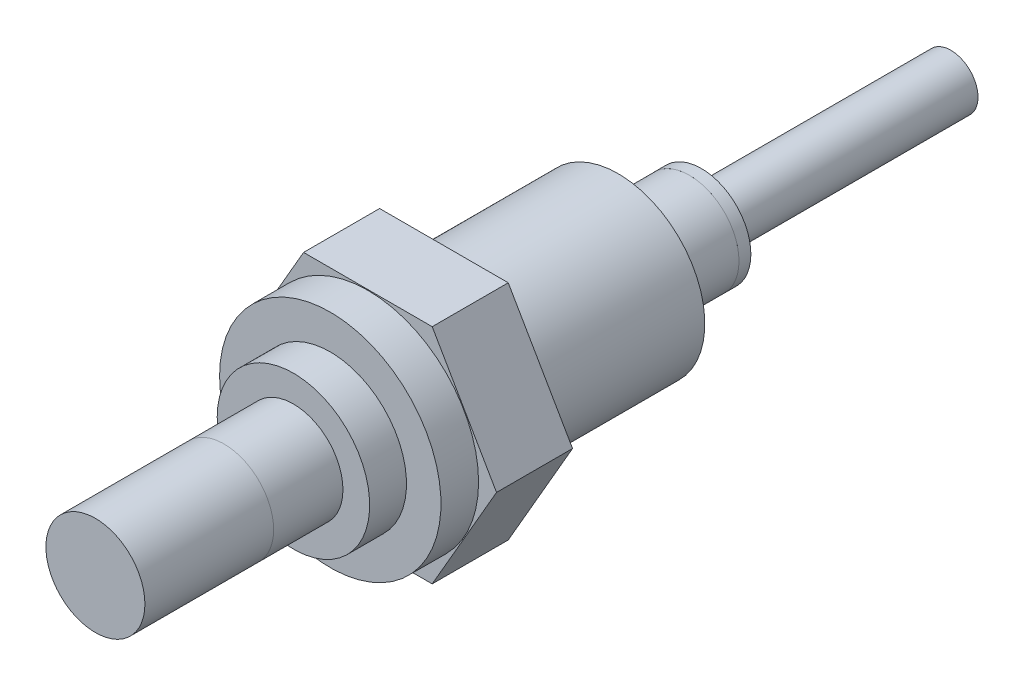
ISO-10303-21;
HEADER;
FILE_DESCRIPTION(('STEP AP214'),'2;1');
FILE_NAME('part.step','',(''),(''),'','','');
FILE_SCHEMA(('AUTOMOTIVE_DESIGN { 1 0 10303 214 1 1 1 1 }'));
ENDSEC;
DATA;
#1=APPLICATION_CONTEXT('core data for automotive mechanical design processes');
#2=APPLICATION_PROTOCOL_DEFINITION('international standard','automotive_design',2000,#1);
#3=PRODUCT_CONTEXT('',#1,'mechanical');
#4=PRODUCT('Part','Part','',(#3));
#5=PRODUCT_RELATED_PRODUCT_CATEGORY('part','',(#4));
#6=PRODUCT_DEFINITION_FORMATION('','',#4);
#7=PRODUCT_DEFINITION_CONTEXT('part definition',#1,'design');
#8=PRODUCT_DEFINITION('design','',#6,#7);
#9=PRODUCT_DEFINITION_SHAPE('','',#8);
#10=(LENGTH_UNIT() NAMED_UNIT(*) SI_UNIT(.MILLI.,.METRE.));
#11=(NAMED_UNIT(*) PLANE_ANGLE_UNIT() SI_UNIT($,.RADIAN.));
#12=(NAMED_UNIT(*) SI_UNIT($,.STERADIAN.) SOLID_ANGLE_UNIT());
#13=UNCERTAINTY_MEASURE_WITH_UNIT(LENGTH_MEASURE(1.E-05),#10,'distance_accuracy_value','');
#14=(GEOMETRIC_REPRESENTATION_CONTEXT(3) GLOBAL_UNCERTAINTY_ASSIGNED_CONTEXT((#13)) GLOBAL_UNIT_ASSIGNED_CONTEXT((#10,
#11,#12)) REPRESENTATION_CONTEXT('',''));
#15=CARTESIAN_POINT('',(0.,0.,0.));
#16=DIRECTION('',(0.,0.,1.));
#17=DIRECTION('',(1.,0.,0.));
#18=AXIS2_PLACEMENT_3D('',#15,#16,#17);
#19=CARTESIAN_POINT('',(0.,1.7526,14.097));
#20=DIRECTION('',(0.,0.,1.));
#21=DIRECTION('',(1.,0.,0.));
#22=AXIS2_PLACEMENT_3D('',#19,#20,#21);
#23=PLANE('',#22);
#24=CARTESIAN_POINT('',(0.,0.,14.097));
#25=DIRECTION('',(0.,0.,1.));
#26=DIRECTION('',(1.,0.,0.));
#27=AXIS2_PLACEMENT_3D('',#24,#25,#26);
#28=CIRCLE('',#27,3.175);
#29=CARTESIAN_POINT('',(3.175,0.,14.097));
#30=VERTEX_POINT('',#29);
#31=EDGE_CURVE('E11',#30,#30,#28,.T.);
#32=ORIENTED_EDGE('',*,*,#31,.F.);
#33=EDGE_LOOP('',(#32));
#34=FACE_BOUND('',#33,.T.);
#35=CARTESIAN_POINT('',(0.,0.,14.097));
#36=DIRECTION('',(0.,0.,1.));
#37=DIRECTION('',(1.,0.,0.));
#38=AXIS2_PLACEMENT_3D('',#35,#36,#37);
#39=CIRCLE('',#38,1.7526);
#40=CARTESIAN_POINT('',(1.7526,0.,14.097));
#41=VERTEX_POINT('',#40);
#42=EDGE_CURVE('E70',#41,#41,#39,.T.);
#43=ORIENTED_EDGE('',*,*,#42,.T.);
#44=EDGE_LOOP('',(#43));
#45=FACE_BOUND('',#44,.T.);
#46=ADVANCED_FACE('F42',(#34,#45),#23,.F.);
#47=CARTESIAN_POINT('',(0.,0.,22.352));
#48=DIRECTION('',(0.,0.,1.));
#49=DIRECTION('',(1.,0.,0.));
#50=AXIS2_PLACEMENT_3D('',#47,#48,#49);
#51=CYLINDRICAL_SURFACE('',#50,3.175);
#52=CARTESIAN_POINT('',(0.,0.,22.352));
#53=DIRECTION('',(0.,0.,1.));
#54=DIRECTION('',(1.,0.,0.));
#55=AXIS2_PLACEMENT_3D('',#52,#53,#54);
#56=CIRCLE('',#55,3.175);
#57=CARTESIAN_POINT('',(3.175,0.,22.352));
#58=VERTEX_POINT('',#57);
#59=EDGE_CURVE('E48',#58,#58,#56,.T.);
#60=ORIENTED_EDGE('',*,*,#59,.F.);
#61=EDGE_LOOP('',(#60));
#62=FACE_BOUND('',#61,.T.);
#63=ORIENTED_EDGE('',*,*,#31,.T.);
#64=EDGE_LOOP('',(#63));
#65=FACE_BOUND('',#64,.T.);
#66=ADVANCED_FACE('F112',(#62,#65),#51,.T.);
#67=CARTESIAN_POINT('',(0.,3.175,22.352));
#68=DIRECTION('',(0.,0.,-1.));
#69=DIRECTION('',(-1.,0.,0.));
#70=AXIS2_PLACEMENT_3D('',#67,#68,#69);
#71=PLANE('',#70);
#72=ORIENTED_EDGE('',*,*,#59,.T.);
#73=EDGE_LOOP('',(#72));
#74=FACE_BOUND('',#73,.T.);
#75=ADVANCED_FACE('F107',(#74),#71,.F.);
#76=CARTESIAN_POINT('',(0.,0.,-32.512));
#77=DIRECTION('',(0.,0.,1.));
#78=DIRECTION('',(1.,0.,0.));
#79=AXIS2_PLACEMENT_3D('',#76,#77,#78);
#80=PLANE('',#79);
#81=CARTESIAN_POINT('',(0.,0.,-32.512));
#82=DIRECTION('',(0.,0.,1.));
#83=DIRECTION('',(1.,0.,0.));
#84=AXIS2_PLACEMENT_3D('',#81,#82,#83);
#85=CIRCLE('',#84,1.7399);
#86=CARTESIAN_POINT('',(1.7399,0.,-32.512));
#87=VERTEX_POINT('',#86);
#88=EDGE_CURVE('E52',#87,#87,#85,.T.);
#89=ORIENTED_EDGE('',*,*,#88,.F.);
#90=EDGE_LOOP('',(#89));
#91=FACE_BOUND('',#90,.T.);
#92=ADVANCED_FACE('F102',(#91),#80,.F.);
#93=CARTESIAN_POINT('',(0.,0.,22.352));
#94=DIRECTION('',(0.,0.,1.));
#95=DIRECTION('',(1.,0.,0.));
#96=AXIS2_PLACEMENT_3D('',#93,#94,#95);
#97=CYLINDRICAL_SURFACE('',#96,1.7399);
#98=CARTESIAN_POINT('',(0.,0.,-16.51));
#99=DIRECTION('',(0.,0.,1.));
#100=DIRECTION('',(1.,0.,0.));
#101=AXIS2_PLACEMENT_3D('',#98,#99,#100);
#102=CIRCLE('',#101,1.7399);
#103=CARTESIAN_POINT('',(1.7399,0.,-16.51));
#104=VERTEX_POINT('',#103);
#105=EDGE_CURVE('E56',#104,#104,#102,.T.);
#106=ORIENTED_EDGE('',*,*,#105,.F.);
#107=EDGE_LOOP('',(#106));
#108=FACE_BOUND('',#107,.T.);
#109=ORIENTED_EDGE('',*,*,#88,.T.);
#110=EDGE_LOOP('',(#109));
#111=FACE_BOUND('',#110,.T.);
#112=ADVANCED_FACE('F96',(#108,#111),#97,.T.);
#113=CARTESIAN_POINT('',(0.,1.7399,-16.51));
#114=DIRECTION('',(0.,0.,1.));
#115=DIRECTION('',(1.,0.,0.));
#116=AXIS2_PLACEMENT_3D('',#113,#114,#115);
#117=PLANE('',#116);
#118=CARTESIAN_POINT('',(0.,0.,-16.51));
#119=DIRECTION('',(0.,0.,1.));
#120=DIRECTION('',(1.,0.,0.));
#121=AXIS2_PLACEMENT_3D('',#118,#119,#120);
#122=CIRCLE('',#121,3.175);
#123=CARTESIAN_POINT('',(3.175,0.,-16.51));
#124=VERTEX_POINT('',#123);
#125=EDGE_CURVE('E61',#124,#124,#122,.T.);
#126=ORIENTED_EDGE('',*,*,#125,.F.);
#127=EDGE_LOOP('',(#126));
#128=FACE_BOUND('',#127,.T.);
#129=ORIENTED_EDGE('',*,*,#105,.T.);
#130=EDGE_LOOP('',(#129));
#131=FACE_BOUND('',#130,.T.);
#132=ADVANCED_FACE('F90',(#128,#131),#117,.F.);
#133=CARTESIAN_POINT('',(0.,0.,22.352));
#134=DIRECTION('',(0.,0.,1.));
#135=DIRECTION('',(1.,0.,0.));
#136=AXIS2_PLACEMENT_3D('',#133,#134,#135);
#137=CYLINDRICAL_SURFACE('',#136,3.175);
#138=CARTESIAN_POINT('',(0.,0.,-15.748));
#139=DIRECTION('',(0.,0.,1.));
#140=DIRECTION('',(1.,0.,0.));
#141=AXIS2_PLACEMENT_3D('',#138,#139,#140);
#142=CIRCLE('',#141,3.175);
#143=CARTESIAN_POINT('',(3.175,0.,-15.748));
#144=VERTEX_POINT('',#143);
#145=EDGE_CURVE('E64',#144,#144,#142,.T.);
#146=ORIENTED_EDGE('',*,*,#145,.F.);
#147=EDGE_LOOP('',(#146));
#148=FACE_BOUND('',#147,.T.);
#149=ORIENTED_EDGE('',*,*,#125,.T.);
#150=EDGE_LOOP('',(#149));
#151=FACE_BOUND('',#150,.T.);
#152=ADVANCED_FACE('F84',(#148,#151),#137,.T.);
#153=CARTESIAN_POINT('',(0.,3.175,-15.748));
#154=DIRECTION('',(0.,0.,-1.));
#155=DIRECTION('',(-1.,0.,0.));
#156=AXIS2_PLACEMENT_3D('',#153,#154,#155);
#157=PLANE('',#156);
#158=CARTESIAN_POINT('',(0.,0.,-15.748));
#159=DIRECTION('',(0.,0.,1.));
#160=DIRECTION('',(1.,0.,0.));
#161=AXIS2_PLACEMENT_3D('',#158,#159,#160);
#162=CIRCLE('',#161,1.7526);
#163=CARTESIAN_POINT('',(1.7526,0.,-15.748));
#164=VERTEX_POINT('',#163);
#165=EDGE_CURVE('E67',#164,#164,#162,.T.);
#166=ORIENTED_EDGE('',*,*,#165,.F.);
#167=EDGE_LOOP('',(#166));
#168=FACE_BOUND('',#167,.T.);
#169=ORIENTED_EDGE('',*,*,#145,.T.);
#170=EDGE_LOOP('',(#169));
#171=FACE_BOUND('',#170,.T.);
#172=ADVANCED_FACE('F78',(#168,#171),#157,.F.);
#173=CARTESIAN_POINT('',(0.,0.,22.352));
#174=DIRECTION('',(0.,0.,1.));
#175=DIRECTION('',(1.,0.,0.));
#176=AXIS2_PLACEMENT_3D('',#173,#174,#175);
#177=CYLINDRICAL_SURFACE('',#176,1.7526);
#178=ORIENTED_EDGE('',*,*,#42,.F.);
#179=EDGE_LOOP('',(#178));
#180=FACE_BOUND('',#179,.T.);
#181=ORIENTED_EDGE('',*,*,#165,.T.);
#182=EDGE_LOOP('',(#181));
#183=FACE_BOUND('',#182,.T.);
#184=ADVANCED_FACE('F75',(#180,#183),#177,.T.);
#185=CLOSED_SHELL('',(#46,#66,#75,#92,#112,#132,#152,#172,#184));
#186=MANIFOLD_SOLID_BREP('B2',#185);
#187=CARTESIAN_POINT('',(0.,0.,-29.3002561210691));
#188=DIRECTION('',(0.,0.,1.));
#189=DIRECTION('',(1.,0.,0.));
#190=AXIS2_PLACEMENT_3D('',#187,#188,#189);
#191=CYLINDRICAL_SURFACE('',#190,3.175);
#192=CARTESIAN_POINT('',(0.,0.,14.097));
#193=DIRECTION('',(0.,0.,1.));
#194=DIRECTION('',(1.,0.,0.));
#195=AXIS2_PLACEMENT_3D('',#192,#193,#194);
#196=CIRCLE('',#195,3.175);
#197=CARTESIAN_POINT('',(3.175,0.,14.097));
#198=VERTEX_POINT('',#197);
#199=EDGE_CURVE('E190',#198,#198,#196,.T.);
#200=ORIENTED_EDGE('',*,*,#199,.F.);
#201=EDGE_LOOP('',(#200));
#202=FACE_BOUND('',#201,.T.);
#203=CARTESIAN_POINT('',(0.,0.,-15.748));
#204=DIRECTION('',(0.,0.,-1.));
#205=DIRECTION('',(-1.,0.,0.));
#206=AXIS2_PLACEMENT_3D('',#203,#204,#205);
#207=CIRCLE('',#206,3.175);
#208=CARTESIAN_POINT('',(-3.175,0.,-15.748));
#209=VERTEX_POINT('',#208);
#210=EDGE_CURVE('E199',#209,#209,#207,.F.);
#211=ORIENTED_EDGE('',*,*,#210,.T.);
#212=EDGE_LOOP('',(#211));
#213=FACE_BOUND('',#212,.T.);
#214=ADVANCED_FACE('F183',(#202,#213),#191,.T.);
#215=CARTESIAN_POINT('',(0.,0.,-29.3002561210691));
#216=DIRECTION('',(0.,0.,1.));
#217=DIRECTION('',(1.,0.,0.));
#218=AXIS2_PLACEMENT_3D('',#215,#216,#217);
#219=CYLINDRICAL_SURFACE('',#218,1.7526);
#220=CARTESIAN_POINT('',(0.,0.,14.097));
#221=DIRECTION('',(0.,0.,1.));
#222=DIRECTION('',(1.,0.,0.));
#223=AXIS2_PLACEMENT_3D('',#220,#221,#222);
#224=CIRCLE('',#223,1.7526);
#225=CARTESIAN_POINT('',(1.7526,0.,14.097));
#226=VERTEX_POINT('',#225);
#227=EDGE_CURVE('E194',#226,#226,#224,.T.);
#228=ORIENTED_EDGE('',*,*,#227,.T.);
#229=EDGE_LOOP('',(#228));
#230=FACE_BOUND('',#229,.T.);
#231=CARTESIAN_POINT('',(0.,0.,-15.748));
#232=DIRECTION('',(0.,0.,-1.));
#233=DIRECTION('',(-1.,0.,0.));
#234=AXIS2_PLACEMENT_3D('',#231,#232,#233);
#235=CIRCLE('',#234,1.7526);
#236=CARTESIAN_POINT('',(-1.7526,0.,-15.748));
#237=VERTEX_POINT('',#236);
#238=EDGE_CURVE('E41',#237,#237,#235,.F.);
#239=ORIENTED_EDGE('',*,*,#238,.F.);
#240=EDGE_LOOP('',(#239));
#241=FACE_BOUND('',#240,.T.);
#242=ADVANCED_FACE('F210',(#230,#241),#219,.F.);
#243=CARTESIAN_POINT('',(0.,0.,14.097));
#244=DIRECTION('',(0.,0.,1.));
#245=DIRECTION('',(1.,0.,0.));
#246=AXIS2_PLACEMENT_3D('',#243,#244,#245);
#247=PLANE('',#246);
#248=ORIENTED_EDGE('',*,*,#227,.F.);
#249=EDGE_LOOP('',(#248));
#250=FACE_BOUND('',#249,.T.);
#251=ORIENTED_EDGE('',*,*,#199,.T.);
#252=EDGE_LOOP('',(#251));
#253=FACE_BOUND('',#252,.T.);
#254=ADVANCED_FACE('F206',(#250,#253),#247,.T.);
#255=CARTESIAN_POINT('',(0.,5.55625,-15.748));
#256=DIRECTION('',(0.,0.,-1.));
#257=DIRECTION('',(-1.,0.,0.));
#258=AXIS2_PLACEMENT_3D('',#255,#256,#257);
#259=PLANE('',#258);
#260=ORIENTED_EDGE('',*,*,#210,.F.);
#261=EDGE_LOOP('',(#260));
#262=FACE_BOUND('',#261,.T.);
#263=ORIENTED_EDGE('',*,*,#238,.T.);
#264=EDGE_LOOP('',(#263));
#265=FACE_BOUND('',#264,.T.);
#266=ADVANCED_FACE('F185',(#262,#265),#259,.T.);
#267=CLOSED_SHELL('',(#214,#242,#254,#266));
#268=MANIFOLD_SOLID_BREP('B6',#267);
#269=CARTESIAN_POINT('',(4.12444598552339,-7.14375,4.8768));
#270=DIRECTION('',(-0.866025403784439,0.5,0.));
#271=DIRECTION('',(-0.5,-0.866025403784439,0.));
#272=AXIS2_PLACEMENT_3D('',#269,#270,#271);
#273=PLANE('',#272);
#274=DIRECTION('',(0.5,0.866025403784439,0.));
#275=VECTOR('',#274,1.);
#276=CARTESIAN_POINT('',(4.12444598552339,-7.14375,0.));
#277=LINE('',#276,#275);
#278=CARTESIAN_POINT('',(4.12444598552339,-7.14375,0.));
#279=VERTEX_POINT('',#278);
#280=CARTESIAN_POINT('',(8.24889197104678,0.,0.));
#281=VERTEX_POINT('',#280);
#282=EDGE_CURVE('E331',#279,#281,#277,.T.);
#283=ORIENTED_EDGE('',*,*,#282,.T.);
#284=DIRECTION('',(0.,0.,-1.));
#285=VECTOR('',#284,1.);
#286=CARTESIAN_POINT('',(8.24889197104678,0.,4.8768));
#287=LINE('',#286,#285);
#288=CARTESIAN_POINT('',(8.24889197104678,0.,4.8768));
#289=VERTEX_POINT('',#288);
#290=EDGE_CURVE('E254',#289,#281,#287,.T.);
#291=ORIENTED_EDGE('',*,*,#290,.F.);
#292=DIRECTION('',(0.5,0.866025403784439,0.));
#293=VECTOR('',#292,1.);
#294=CARTESIAN_POINT('',(4.12444598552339,-7.14375,4.8768));
#295=LINE('',#294,#293);
#296=CARTESIAN_POINT('',(4.12444598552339,-7.14375,4.8768));
#297=VERTEX_POINT('',#296);
#298=EDGE_CURVE('E342',#297,#289,#295,.T.);
#299=ORIENTED_EDGE('',*,*,#298,.F.);
#300=DIRECTION('',(0.,0.,-1.));
#301=VECTOR('',#300,1.);
#302=CARTESIAN_POINT('',(4.12444598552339,-7.14375,4.8768));
#303=LINE('',#302,#301);
#304=EDGE_CURVE('E327',#297,#279,#303,.T.);
#305=ORIENTED_EDGE('',*,*,#304,.T.);
#306=EDGE_LOOP('',(#283,#291,#299,#305));
#307=FACE_BOUND('',#306,.T.);
#308=ADVANCED_FACE('F246',(#307),#273,.F.);
#309=CARTESIAN_POINT('',(8.24889197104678,0.,4.8768));
#310=DIRECTION('',(-0.866025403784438,-0.5,0.));
#311=DIRECTION('',(0.500000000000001,-0.866025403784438,0.));
#312=AXIS2_PLACEMENT_3D('',#309,#310,#311);
#313=PLANE('',#312);
#314=DIRECTION('',(-0.500000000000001,0.866025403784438,0.));
#315=VECTOR('',#314,1.);
#316=CARTESIAN_POINT('',(8.24889197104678,0.,0.));
#317=LINE('',#316,#315);
#318=CARTESIAN_POINT('',(4.12444598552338,7.14375000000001,0.));
#319=VERTEX_POINT('',#318);
#320=EDGE_CURVE('E334',#281,#319,#317,.T.);
#321=ORIENTED_EDGE('',*,*,#320,.T.);
#322=DIRECTION('',(0.,0.,-1.));
#323=VECTOR('',#322,1.);
#324=CARTESIAN_POINT('',(4.12444598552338,7.14375000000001,4.8768));
#325=LINE('',#324,#323);
#326=CARTESIAN_POINT('',(4.12444598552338,7.14375000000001,4.8768));
#327=VERTEX_POINT('',#326);
#328=EDGE_CURVE('E346',#327,#319,#325,.T.);
#329=ORIENTED_EDGE('',*,*,#328,.F.);
#330=DIRECTION('',(-0.500000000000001,0.866025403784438,0.));
#331=VECTOR('',#330,1.);
#332=CARTESIAN_POINT('',(8.24889197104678,0.,4.8768));
#333=LINE('',#332,#331);
#334=EDGE_CURVE('E300',#289,#327,#333,.T.);
#335=ORIENTED_EDGE('',*,*,#334,.F.);
#336=ORIENTED_EDGE('',*,*,#290,.T.);
#337=EDGE_LOOP('',(#321,#329,#335,#336));
#338=FACE_BOUND('',#337,.T.);
#339=ADVANCED_FACE('F349',(#338),#313,.F.);
#340=CARTESIAN_POINT('',(4.12444598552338,7.14375000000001,4.8768));
#341=DIRECTION('',(0.,-1.,0.));
#342=DIRECTION('',(1.,0.,0.));
#343=AXIS2_PLACEMENT_3D('',#340,#341,#342);
#344=PLANE('',#343);
#345=DIRECTION('',(-1.,0.,0.));
#346=VECTOR('',#345,1.);
#347=CARTESIAN_POINT('',(4.12444598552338,7.14375000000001,0.));
#348=LINE('',#347,#346);
#349=CARTESIAN_POINT('',(-4.12444598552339,7.14375000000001,0.));
#350=VERTEX_POINT('',#349);
#351=EDGE_CURVE('E337',#319,#350,#348,.T.);
#352=ORIENTED_EDGE('',*,*,#351,.T.);
#353=DIRECTION('',(0.,0.,-1.));
#354=VECTOR('',#353,1.);
#355=CARTESIAN_POINT('',(-4.12444598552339,7.14375000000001,4.8768));
#356=LINE('',#355,#354);
#357=CARTESIAN_POINT('',(-4.12444598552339,7.14375000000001,4.8768));
#358=VERTEX_POINT('',#357);
#359=EDGE_CURVE('E322',#358,#350,#356,.T.);
#360=ORIENTED_EDGE('',*,*,#359,.F.);
#361=DIRECTION('',(-1.,0.,0.));
#362=VECTOR('',#361,1.);
#363=CARTESIAN_POINT('',(4.12444598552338,7.14375000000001,4.8768));
#364=LINE('',#363,#362);
#365=EDGE_CURVE('E313',#327,#358,#364,.T.);
#366=ORIENTED_EDGE('',*,*,#365,.F.);
#367=ORIENTED_EDGE('',*,*,#328,.T.);
#368=EDGE_LOOP('',(#352,#360,#366,#367));
#369=FACE_BOUND('',#368,.T.);
#370=ADVANCED_FACE('F357',(#369),#344,.F.);
#371=CARTESIAN_POINT('',(-4.12444598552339,7.14375000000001,4.8768));
#372=DIRECTION('',(0.866025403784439,-0.5,0.));
#373=DIRECTION('',(0.5,0.866025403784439,0.));
#374=AXIS2_PLACEMENT_3D('',#371,#372,#373);
#375=PLANE('',#374);
#376=DIRECTION('',(-0.5,-0.866025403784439,0.));
#377=VECTOR('',#376,1.);
#378=CARTESIAN_POINT('',(-4.12444598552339,7.14375000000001,0.));
#379=LINE('',#378,#377);
#380=CARTESIAN_POINT('',(-8.24889197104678,0.,0.));
#381=VERTEX_POINT('',#380);
#382=EDGE_CURVE('E321',#350,#381,#379,.T.);
#383=ORIENTED_EDGE('',*,*,#382,.T.);
#384=DIRECTION('',(0.,0.,-1.));
#385=VECTOR('',#384,1.);
#386=CARTESIAN_POINT('',(-8.24889197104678,0.,4.8768));
#387=LINE('',#386,#385);
#388=CARTESIAN_POINT('',(-8.24889197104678,0.,4.8768));
#389=VERTEX_POINT('',#388);
#390=EDGE_CURVE('E318',#389,#381,#387,.T.);
#391=ORIENTED_EDGE('',*,*,#390,.F.);
#392=DIRECTION('',(-0.5,-0.866025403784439,0.));
#393=VECTOR('',#392,1.);
#394=CARTESIAN_POINT('',(-4.12444598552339,7.14375000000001,4.8768));
#395=LINE('',#394,#393);
#396=EDGE_CURVE('E307',#358,#389,#395,.T.);
#397=ORIENTED_EDGE('',*,*,#396,.F.);
#398=ORIENTED_EDGE('',*,*,#359,.T.);
#399=EDGE_LOOP('',(#383,#391,#397,#398));
#400=FACE_BOUND('',#399,.T.);
#401=ADVANCED_FACE('F319',(#400),#375,.F.);
#402=CARTESIAN_POINT('',(-8.24889197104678,0.,4.8768));
#403=DIRECTION('',(0.866025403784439,0.5,0.));
#404=DIRECTION('',(-0.5,0.866025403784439,0.));
#405=AXIS2_PLACEMENT_3D('',#402,#403,#404);
#406=PLANE('',#405);
#407=DIRECTION('',(0.5,-0.866025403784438,0.));
#408=VECTOR('',#407,1.);
#409=CARTESIAN_POINT('',(-8.24889197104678,0.,0.));
#410=LINE('',#409,#408);
#411=CARTESIAN_POINT('',(-4.12444598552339,-7.14375,0.));
#412=VERTEX_POINT('',#411);
#413=EDGE_CURVE('E285',#381,#412,#410,.T.);
#414=ORIENTED_EDGE('',*,*,#413,.T.);
#415=DIRECTION('',(0.,0.,-1.));
#416=VECTOR('',#415,1.);
#417=CARTESIAN_POINT('',(-4.12444598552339,-7.14375,4.8768));
#418=LINE('',#417,#416);
#419=CARTESIAN_POINT('',(-4.12444598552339,-7.14375,4.8768));
#420=VERTEX_POINT('',#419);
#421=EDGE_CURVE('E323',#420,#412,#418,.T.);
#422=ORIENTED_EDGE('',*,*,#421,.F.);
#423=DIRECTION('',(0.5,-0.866025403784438,0.));
#424=VECTOR('',#423,1.);
#425=CARTESIAN_POINT('',(-8.24889197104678,0.,4.8768));
#426=LINE('',#425,#424);
#427=EDGE_CURVE('E311',#389,#420,#426,.T.);
#428=ORIENTED_EDGE('',*,*,#427,.F.);
#429=ORIENTED_EDGE('',*,*,#390,.T.);
#430=EDGE_LOOP('',(#414,#422,#428,#429));
#431=FACE_BOUND('',#430,.T.);
#432=ADVANCED_FACE('F325',(#431),#406,.F.);
#433=CARTESIAN_POINT('',(-4.12444598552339,-7.14375,4.8768));
#434=DIRECTION('',(0.,1.,0.));
#435=DIRECTION('',(-1.,0.,0.));
#436=AXIS2_PLACEMENT_3D('',#433,#434,#435);
#437=PLANE('',#436);
#438=DIRECTION('',(1.,0.,0.));
#439=VECTOR('',#438,1.);
#440=CARTESIAN_POINT('',(-4.12444598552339,-7.14375,0.));
#441=LINE('',#440,#439);
#442=EDGE_CURVE('E291',#412,#279,#441,.T.);
#443=ORIENTED_EDGE('',*,*,#442,.T.);
#444=ORIENTED_EDGE('',*,*,#304,.F.);
#445=DIRECTION('',(1.,0.,0.));
#446=VECTOR('',#445,1.);
#447=CARTESIAN_POINT('',(-4.12444598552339,-7.14375,4.8768));
#448=LINE('',#447,#446);
#449=EDGE_CURVE('E262',#420,#297,#448,.T.);
#450=ORIENTED_EDGE('',*,*,#449,.F.);
#451=ORIENTED_EDGE('',*,*,#421,.T.);
#452=EDGE_LOOP('',(#443,#444,#450,#451));
#453=FACE_BOUND('',#452,.T.);
#454=ADVANCED_FACE('F417',(#453),#437,.F.);
#455=CARTESIAN_POINT('',(8.24889197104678,0.,4.8768));
#456=DIRECTION('',(0.,0.,1.));
#457=DIRECTION('',(1.,0.,0.));
#458=AXIS2_PLACEMENT_3D('',#455,#456,#457);
#459=PLANE('',#458);
#460=CARTESIAN_POINT('',(0.,0.,4.8768));
#461=DIRECTION('',(0.,0.,1.));
#462=DIRECTION('',(1.,0.,0.));
#463=AXIS2_PLACEMENT_3D('',#460,#461,#462);
#464=CIRCLE('',#463,7.0993);
#465=CARTESIAN_POINT('',(7.0993,0.,4.8768));
#466=VERTEX_POINT('',#465);
#467=EDGE_CURVE('E181',#466,#466,#464,.T.);
#468=ORIENTED_EDGE('',*,*,#467,.F.);
#469=EDGE_LOOP('',(#468));
#470=FACE_BOUND('',#469,.T.);
#471=ORIENTED_EDGE('',*,*,#298,.T.);
#472=ORIENTED_EDGE('',*,*,#334,.T.);
#473=ORIENTED_EDGE('',*,*,#365,.T.);
#474=ORIENTED_EDGE('',*,*,#396,.T.);
#475=ORIENTED_EDGE('',*,*,#427,.T.);
#476=ORIENTED_EDGE('',*,*,#449,.T.);
#477=EDGE_LOOP('',(#471,#472,#473,#474,#475,#476));
#478=FACE_BOUND('',#477,.T.);
#479=ADVANCED_FACE('F309',(#470,#478),#459,.T.);
#480=CARTESIAN_POINT('',(8.24889197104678,0.,0.));
#481=DIRECTION('',(0.,0.,1.));
#482=DIRECTION('',(1.,0.,0.));
#483=AXIS2_PLACEMENT_3D('',#480,#481,#482);
#484=PLANE('',#483);
#485=CARTESIAN_POINT('',(0.,0.,0.));
#486=DIRECTION('',(0.,0.,-1.));
#487=DIRECTION('',(-1.,0.,0.));
#488=AXIS2_PLACEMENT_3D('',#485,#486,#487);
#489=CIRCLE('',#488,5.55625);
#490=CARTESIAN_POINT('',(-5.55625,0.,0.));
#491=VERTEX_POINT('',#490);
#492=EDGE_CURVE('E369',#491,#491,#489,.T.);
#493=ORIENTED_EDGE('',*,*,#492,.F.);
#494=EDGE_LOOP('',(#493));
#495=FACE_BOUND('',#494,.T.);
#496=ORIENTED_EDGE('',*,*,#282,.F.);
#497=ORIENTED_EDGE('',*,*,#442,.F.);
#498=ORIENTED_EDGE('',*,*,#413,.F.);
#499=ORIENTED_EDGE('',*,*,#382,.F.);
#500=ORIENTED_EDGE('',*,*,#351,.F.);
#501=ORIENTED_EDGE('',*,*,#320,.F.);
#502=EDGE_LOOP('',(#496,#497,#498,#499,#500,#501));
#503=FACE_BOUND('',#502,.T.);
#504=ADVANCED_FACE('F354',(#495,#503),#484,.F.);
#505=CARTESIAN_POINT('',(0.,0.,0.));
#506=DIRECTION('',(0.,0.,-1.));
#507=DIRECTION('',(-1.,0.,0.));
#508=AXIS2_PLACEMENT_3D('',#505,#506,#507);
#509=CYLINDRICAL_SURFACE('',#508,7.0993);
#510=CARTESIAN_POINT('',(0.,0.,7.2898));
#511=DIRECTION('',(0.,0.,-1.));
#512=DIRECTION('',(-1.,0.,0.));
#513=AXIS2_PLACEMENT_3D('',#510,#511,#512);
#514=CIRCLE('',#513,7.0993);
#515=CARTESIAN_POINT('',(-7.0993,0.,7.2898));
#516=VERTEX_POINT('',#515);
#517=EDGE_CURVE('E335',#516,#516,#514,.T.);
#518=ORIENTED_EDGE('',*,*,#517,.T.);
#519=EDGE_LOOP('',(#518));
#520=FACE_BOUND('',#519,.T.);
#521=ORIENTED_EDGE('',*,*,#467,.T.);
#522=EDGE_LOOP('',(#521));
#523=FACE_BOUND('',#522,.T.);
#524=ADVANCED_FACE('F407',(#520,#523),#509,.T.);
#525=CARTESIAN_POINT('',(0.,7.0993,7.2898));
#526=DIRECTION('',(0.,0.,1.));
#527=DIRECTION('',(1.,0.,0.));
#528=AXIS2_PLACEMENT_3D('',#525,#526,#527);
#529=PLANE('',#528);
#530=CARTESIAN_POINT('',(0.,0.,7.2898));
#531=DIRECTION('',(0.,0.,-1.));
#532=DIRECTION('',(-1.,0.,0.));
#533=AXIS2_PLACEMENT_3D('',#530,#531,#532);
#534=CIRCLE('',#533,4.8895);
#535=CARTESIAN_POINT('',(-4.8895,0.,7.2898));
#536=VERTEX_POINT('',#535);
#537=EDGE_CURVE('E363',#536,#536,#534,.T.);
#538=ORIENTED_EDGE('',*,*,#537,.T.);
#539=EDGE_LOOP('',(#538));
#540=FACE_BOUND('',#539,.T.);
#541=ORIENTED_EDGE('',*,*,#517,.F.);
#542=EDGE_LOOP('',(#541));
#543=FACE_BOUND('',#542,.T.);
#544=ADVANCED_FACE('F401',(#540,#543),#529,.T.);
#545=CARTESIAN_POINT('',(0.,0.,0.));
#546=DIRECTION('',(0.,0.,-1.));
#547=DIRECTION('',(-1.,0.,0.));
#548=AXIS2_PLACEMENT_3D('',#545,#546,#547);
#549=CYLINDRICAL_SURFACE('',#548,4.8895);
#550=CARTESIAN_POINT('',(0.,0.,9.652));
#551=DIRECTION('',(0.,0.,-1.));
#552=DIRECTION('',(-1.,0.,0.));
#553=AXIS2_PLACEMENT_3D('',#550,#551,#552);
#554=CIRCLE('',#553,4.8895);
#555=CARTESIAN_POINT('',(-4.8895,0.,9.652));
#556=VERTEX_POINT('',#555);
#557=EDGE_CURVE('E366',#556,#556,#554,.T.);
#558=ORIENTED_EDGE('',*,*,#557,.T.);
#559=EDGE_LOOP('',(#558));
#560=FACE_BOUND('',#559,.T.);
#561=ORIENTED_EDGE('',*,*,#537,.F.);
#562=EDGE_LOOP('',(#561));
#563=FACE_BOUND('',#562,.T.);
#564=ADVANCED_FACE('F395',(#560,#563),#549,.T.);
#565=CARTESIAN_POINT('',(0.,4.8895,9.652));
#566=DIRECTION('',(0.,0.,1.));
#567=DIRECTION('',(1.,0.,0.));
#568=AXIS2_PLACEMENT_3D('',#565,#566,#567);
#569=PLANE('',#568);
#570=CARTESIAN_POINT('',(0.,0.,9.652));
#571=DIRECTION('',(0.,0.,1.));
#572=DIRECTION('',(1.,0.,0.));
#573=AXIS2_PLACEMENT_3D('',#570,#571,#572);
#574=CIRCLE('',#573,3.175);
#575=CARTESIAN_POINT('',(3.175,0.,9.652));
#576=VERTEX_POINT('',#575);
#577=EDGE_CURVE('E376',#576,#576,#574,.T.);
#578=ORIENTED_EDGE('',*,*,#577,.F.);
#579=EDGE_LOOP('',(#578));
#580=FACE_BOUND('',#579,.T.);
#581=ORIENTED_EDGE('',*,*,#557,.F.);
#582=EDGE_LOOP('',(#581));
#583=FACE_BOUND('',#582,.T.);
#584=ADVANCED_FACE('F391',(#580,#583),#569,.T.);
#585=CARTESIAN_POINT('',(0.,0.,0.));
#586=DIRECTION('',(0.,0.,-1.));
#587=DIRECTION('',(-1.,0.,0.));
#588=AXIS2_PLACEMENT_3D('',#585,#586,#587);
#589=CYLINDRICAL_SURFACE('',#588,5.55625);
#590=ORIENTED_EDGE('',*,*,#492,.T.);
#591=EDGE_LOOP('',(#590));
#592=FACE_BOUND('',#591,.T.);
#593=CARTESIAN_POINT('',(0.,0.,-11.176));
#594=DIRECTION('',(0.,0.,-1.));
#595=DIRECTION('',(-1.,0.,0.));
#596=AXIS2_PLACEMENT_3D('',#593,#594,#595);
#597=CIRCLE('',#596,5.55625);
#598=CARTESIAN_POINT('',(-5.55625,0.,-11.176));
#599=VERTEX_POINT('',#598);
#600=EDGE_CURVE('E372',#599,#599,#597,.T.);
#601=ORIENTED_EDGE('',*,*,#600,.F.);
#602=EDGE_LOOP('',(#601));
#603=FACE_BOUND('',#602,.T.);
#604=ADVANCED_FACE('F394',(#592,#603),#589,.T.);
#605=CARTESIAN_POINT('',(0.,5.55625,-11.176));
#606=DIRECTION('',(0.,0.,-1.));
#607=DIRECTION('',(-1.,0.,0.));
#608=AXIS2_PLACEMENT_3D('',#605,#606,#607);
#609=PLANE('',#608);
#610=CARTESIAN_POINT('',(0.,0.,-11.176));
#611=DIRECTION('',(0.,0.,1.));
#612=DIRECTION('',(1.,0.,0.));
#613=AXIS2_PLACEMENT_3D('',#610,#611,#612);
#614=CIRCLE('',#613,3.175);
#615=CARTESIAN_POINT('',(3.175,0.,-11.176));
#616=VERTEX_POINT('',#615);
#617=EDGE_CURVE('E375',#616,#616,#614,.T.);
#618=ORIENTED_EDGE('',*,*,#617,.T.);
#619=EDGE_LOOP('',(#618));
#620=FACE_BOUND('',#619,.T.);
#621=ORIENTED_EDGE('',*,*,#600,.T.);
#622=EDGE_LOOP('',(#621));
#623=FACE_BOUND('',#622,.T.);
#624=ADVANCED_FACE('F382',(#620,#623),#609,.T.);
#625=CARTESIAN_POINT('',(0.,0.,-11.176));
#626=DIRECTION('',(0.,0.,1.));
#627=DIRECTION('',(1.,0.,0.));
#628=AXIS2_PLACEMENT_3D('',#625,#626,#627);
#629=CYLINDRICAL_SURFACE('',#628,3.175);
#630=ORIENTED_EDGE('',*,*,#617,.F.);
#631=EDGE_LOOP('',(#630));
#632=FACE_BOUND('',#631,.T.);
#633=ORIENTED_EDGE('',*,*,#577,.T.);
#634=EDGE_LOOP('',(#633));
#635=FACE_BOUND('',#634,.T.);
#636=ADVANCED_FACE('F385',(#632,#635),#629,.F.);
#637=CLOSED_SHELL('',(#308,#339,#370,#401,#432,#454,#479,#504,#524,#544,#564,#584,#604,#624,#636));
#638=MANIFOLD_SOLID_BREP('B36',#637);
#639=ADVANCED_BREP_SHAPE_REPRESENTATION('',(#18,#186,#268,#638),#14);
#640=SHAPE_DEFINITION_REPRESENTATION(#9,#639);
ENDSEC;
END-ISO-10303-21;
